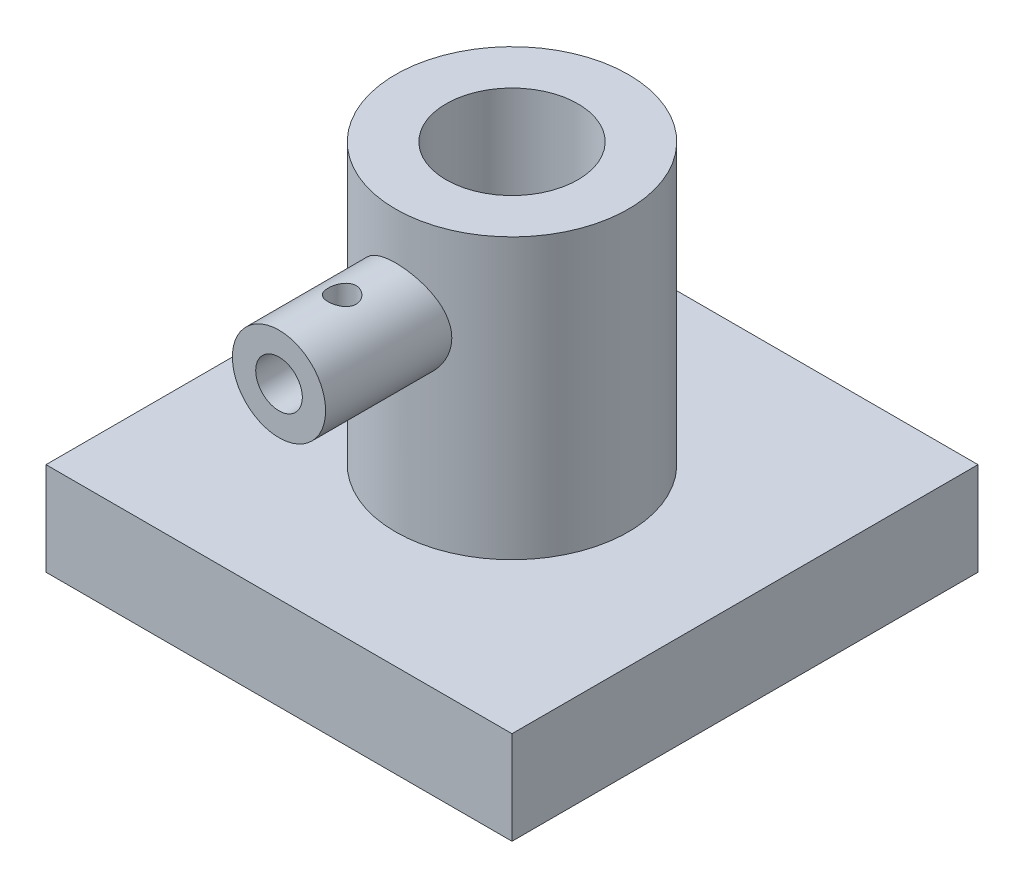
from build123d import *

# Parameters (mm, degrees)
SKETCH1_W               = 50
SKETCH1_H               = 50
EXTRUDE1_DEPTH          = 10
SKETCH3_R               = 12.5
EXTRUDE3_DEPTH          = 30
SKETCH4_W               = 25
SKETCH4_H               = 5
SKETCH6_R               = 7.071067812
CUT_EXTRUDE1_DEPTH      = 54.385391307
CUT_EXTRUDE2_REACH      = 55.385
CUT_EXTRUDE2_END_RADIUS = 2.5
SKETCH7_R               = 1.5


with BuildPart() as part:
    # Sketch1 → Extrude1 (new body)
    with BuildSketch(Plane(origin=(0, 0, 0), x_dir=(1, 0, 0), z_dir=(0, 1, 0))):
        Rectangle(SKETCH1_W, SKETCH1_H)
    extrude(amount=-EXTRUDE1_DEPTH)

    # Sketch3 → Extrude3 (add)
    with BuildSketch(Plane(origin=(0, 0, 0), x_dir=(-1, 0, 0), z_dir=(0, 1, 0))):
        with Locations(Location((0, 0, 0), (0, 0, 90))):
            Circle(SKETCH3_R)
    extrude(amount=EXTRUDE3_DEPTH)

    # Sketch4 → Revolve1 (revolve)
    with BuildSketch(Plane(origin=(0, 0, 0), x_dir=(0, 0, -1), z_dir=(1, 0, 0))):
        with Locations((-12.5, 22.5)):
            Rectangle(SKETCH4_W, SKETCH4_H)
    revolve(axis=Axis((0, 20, 0), (0, 0, 1)))

    # Sketch5 → Cut-Revolve1 (revolve, cut)
    with BuildSketch(Plane(origin=(0, 0, 0), x_dir=(0, 0, -1), z_dir=(1, 0, 0)), mode=Mode.PRIVATE) as cut_revolve1_sk:
        Polygon((-25, 20), (-25, 22.5), (-8, 22.5), (-8, 25), (-5, 25), (-5, 20), align=None)
    revolve(cut_revolve1_sk.sketch.rotate(Axis((0, 20, 5), (0, 0, 1)), 90), axis=Axis((0, 20, 5), (0, 0, 1)), mode=Mode.SUBTRACT)

    # Sketch6 → Cut-Extrude1 (cut, through all)
    with BuildSketch(Plane(origin=(0, 30, 0), x_dir=(-1, 0, 0), z_dir=(0, 1, 0))):
        with Locations(Location((0, 0, 0), (0, 0, 90))):
            Circle(SKETCH6_R)
    extrude(amount=-CUT_EXTRUDE1_DEPTH, mode=Mode.SUBTRACT)

    # Cut-Extrude2: up to this cylinder (the profile starts outside it)
    cut_extrude2_end = Plane(origin=(0, 20, 18.22822), z_dir=(0, 0, -1)) * Cylinder(CUT_EXTRUDE2_END_RADIUS, 116.77, mode=Mode.PRIVATE)
    # Sketch7 → Cut-Extrude2 (cut, up to the surface)
    with BuildSketch(Plane(origin=(0, 30, 0), x_dir=(-1, 0, 0), z_dir=(0, 1, 0)), mode=Mode.PRIVATE) as cut_extrude2_sk1:
        with Locations(Location((0, 18.228219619, 0), (0, 0, 90))):
            Circle(SKETCH7_R)
    cut_extrude2_tool1 = extrude(cut_extrude2_sk1.sketch, amount=-CUT_EXTRUDE2_REACH, mode=Mode.PRIVATE) - cut_extrude2_end
    add(cut_extrude2_tool1.solids().sort_by_distance((0, 30, 18.22822))[0], mode=Mode.SUBTRACT)


solid = part.part
